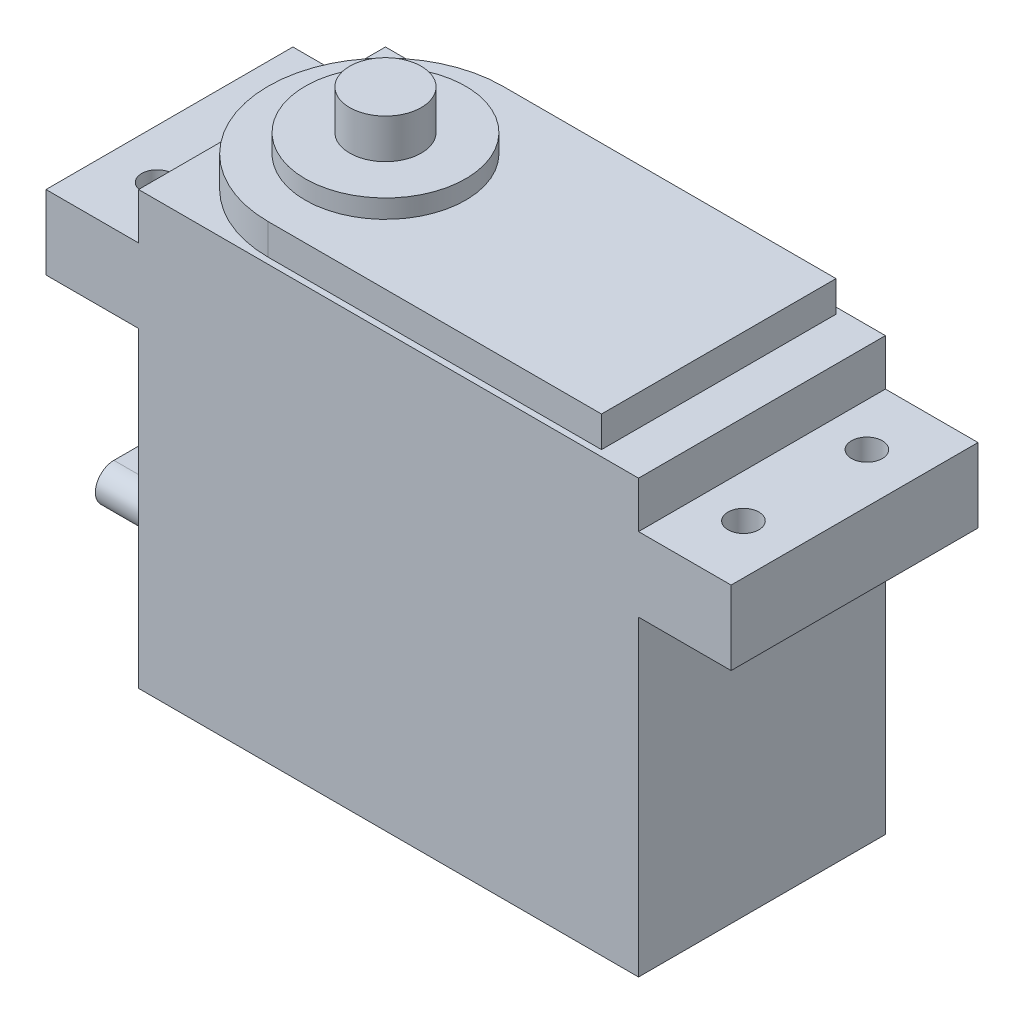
from build123d import *

# Parameters (mm, degrees)
EXTRUSION1_DEPTH        = 20
ESQUISSE2_R             = 1.25
ENL_V_MAT_EXTRU_1_DEPTH = 61.667639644
EXTRUSION2_DEPTH        = 2.5
ESQUISSE4_R             = 6.5
EXTRUSION3_DEPTH        = 1.5
ESQUISSE5_R             = 2.9
EXTRUSION4_DEPTH        = 3.2
EXTRUSION5_DEPTH        = 0.5
EXTRUSION6_DEPTH        = 10


with BuildPart() as part:
    # Esquisse1 → Extrusion1 (new body)
    with BuildSketch(Plane.XY):
        Polygon((48, 31.25), (40.5, 31.25), (40.5, 35), (0, 35), (0, 31.25), (-7.5, 31.25), (-7.5, 25.25), (0, 25.25), (0, 0), (40.5, 0), (40.5, 25.25), (48, 25.25), align=None)
    extrude(amount=EXTRUSION1_DEPTH)

    # Esquisse2 → Enl_v. mat.-Extru.1 (cut, through all)
    with BuildSketch(Plane(origin=(0, 31.25, 0), x_dir=(1, 0, 0), z_dir=(0, 1, 0))):
        with Locations(Location((-3.5, -5, 0), (0, 0, 270))):
            Circle(ESQUISSE2_R)
        with Locations(Location((-3.5, -15, 0), (0, 0, 270))):
            Circle(ESQUISSE2_R)
        with Locations(Location((44, -15, 0), (0, 0, 270))):
            Circle(ESQUISSE2_R)
        with Locations(Location((44, -5, 0), (0, 0, 270))):
            Circle(ESQUISSE2_R)
    extrude(amount=-ENL_V_MAT_EXTRU_1_DEPTH, mode=Mode.SUBTRACT)

    # Esquisse3 → Extrusion2 (add)
    with BuildSketch(Plane(origin=(0, 35, 0), x_dir=(1, 0, 0), z_dir=(0, 1, 0))):
        with BuildLine():
            Line((10, -0.5), (37, -0.5))
            Line((37, -0.5), (37, -19.5))
            Line((37, -19.5), (10, -19.5))
            ThreePointArc((10, -19.5), (0.5, -10), (10, -0.5))
        make_face()
    extrude(amount=EXTRUSION2_DEPTH)

    # Esquisse4 → Extrusion3 (add)
    with BuildSketch(Plane(origin=(0, 37.5, 0), x_dir=(1, 0, 0), z_dir=(0, 1, 0))):
        with Locations(Location((10, -10, 0), (0, 0, 270))):
            Circle(ESQUISSE4_R)
    extrude(amount=EXTRUSION3_DEPTH)

    # Esquisse5 → Extrusion4 (add)
    with BuildSketch(Plane(origin=(0, 39, 0), x_dir=(1, 0, 0), z_dir=(0, 1, 0))):
        with Locations(Location((10, -10, 0), (0, 0, 270))):
            Circle(ESQUISSE5_R)
    extrude(amount=EXTRUSION4_DEPTH)

    # Esquisse6 → Extrusion5 (add)
    with BuildSketch(Plane.ZY):
        with BuildLine():
            Line((8.5, 7), (11.5, 7))
            ThreePointArc((11.5, 7), (13.5, 5), (11.5, 3))
            Line((11.5, 3), (8.5, 3))
            ThreePointArc((8.5, 3), (6.5, 5), (8.5, 7))
        make_face()
    extrude(amount=EXTRUSION5_DEPTH)

    # Esquisse7 → Extrusion6 (add)
    with BuildSketch(Plane.ZY.offset(0.5)):
        with BuildLine():
            Line((8.5, 3.5), (11.5, 3.5))
            ThreePointArc((11.5, 3.5), (13, 5), (11.5, 6.5))
            Line((11.5, 6.5), (8.5, 6.5))
            ThreePointArc((8.5, 6.5), (7, 5), (8.5, 3.5))
        make_face()
    extrude(amount=EXTRUSION6_DEPTH)


solid = part.part
